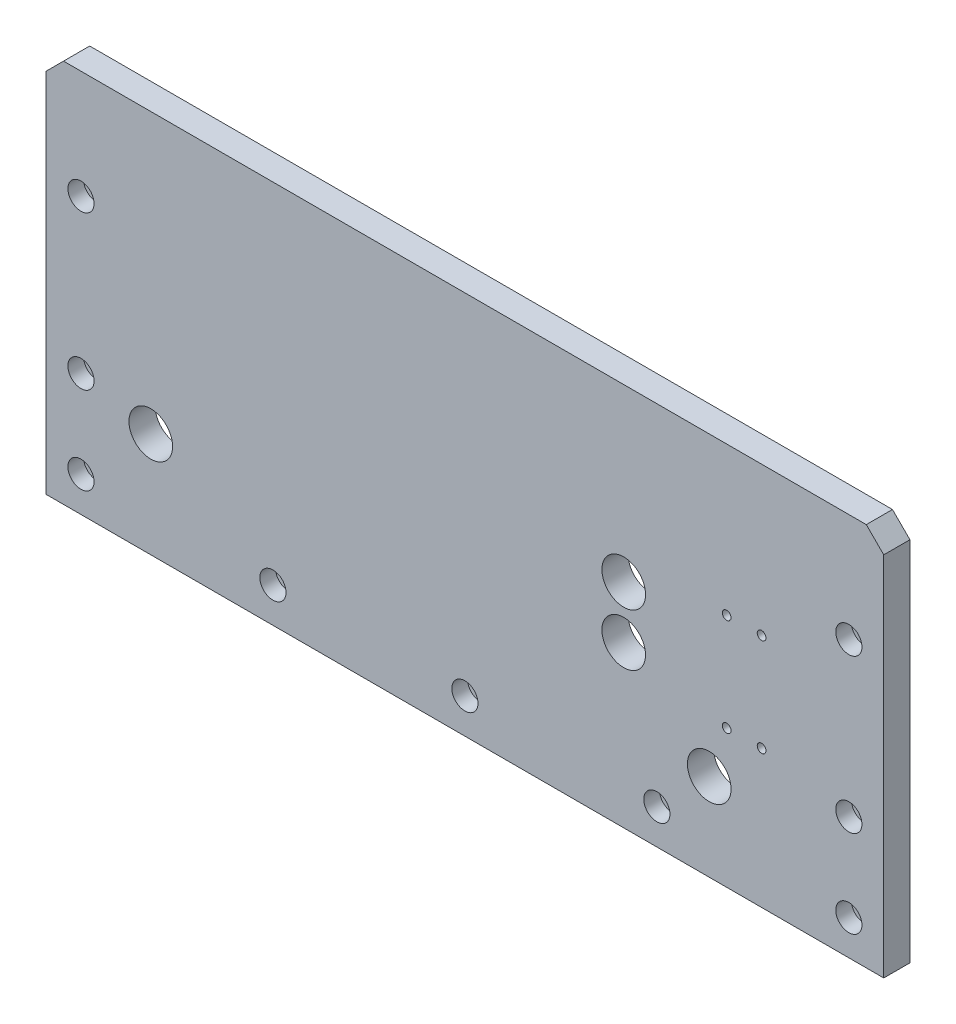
ISO-10303-21;
HEADER;
FILE_DESCRIPTION(('STEP AP214'),'2;1');
FILE_NAME('part.step','',(''),(''),'','','');
FILE_SCHEMA(('AUTOMOTIVE_DESIGN { 1 0 10303 214 1 1 1 1 }'));
ENDSEC;
DATA;
#1=APPLICATION_CONTEXT('core data for automotive mechanical design processes');
#2=APPLICATION_PROTOCOL_DEFINITION('international standard','automotive_design',2000,#1);
#3=PRODUCT_CONTEXT('',#1,'mechanical');
#4=PRODUCT('Part','Part','',(#3));
#5=PRODUCT_RELATED_PRODUCT_CATEGORY('part','',(#4));
#6=PRODUCT_DEFINITION_FORMATION('','',#4);
#7=PRODUCT_DEFINITION_CONTEXT('part definition',#1,'design');
#8=PRODUCT_DEFINITION('design','',#6,#7);
#9=PRODUCT_DEFINITION_SHAPE('','',#8);
#10=(LENGTH_UNIT() NAMED_UNIT(*) SI_UNIT(.MILLI.,.METRE.));
#11=(NAMED_UNIT(*) PLANE_ANGLE_UNIT() SI_UNIT($,.RADIAN.));
#12=(NAMED_UNIT(*) SI_UNIT($,.STERADIAN.) SOLID_ANGLE_UNIT());
#13=UNCERTAINTY_MEASURE_WITH_UNIT(LENGTH_MEASURE(1.E-05),#10,'distance_accuracy_value','');
#14=(GEOMETRIC_REPRESENTATION_CONTEXT(3) GLOBAL_UNCERTAINTY_ASSIGNED_CONTEXT((#13)) GLOBAL_UNIT_ASSIGNED_CONTEXT((#10,
#11,#12)) REPRESENTATION_CONTEXT('',''));
#15=CARTESIAN_POINT('',(0.,0.,0.));
#16=DIRECTION('',(0.,0.,1.));
#17=DIRECTION('',(1.,0.,0.));
#18=AXIS2_PLACEMENT_3D('',#15,#16,#17);
#19=CARTESIAN_POINT('',(240.,-110.,15.));
#20=DIRECTION('',(-1.,0.,0.));
#21=DIRECTION('',(0.,0.,1.));
#22=AXIS2_PLACEMENT_3D('',#19,#20,#21);
#23=PLANE('',#22);
#24=DIRECTION('',(0.,1.,0.));
#25=VECTOR('',#24,1.);
#26=CARTESIAN_POINT('',(240.,-110.,0.));
#27=LINE('',#26,#25);
#28=CARTESIAN_POINT('',(240.,-110.,0.));
#29=VERTEX_POINT('',#28);
#30=CARTESIAN_POINT('',(240.,100.,0.));
#31=VERTEX_POINT('',#30);
#32=EDGE_CURVE('E98',#29,#31,#27,.T.);
#33=ORIENTED_EDGE('',*,*,#32,.T.);
#34=DIRECTION('',(0.,0.,1.));
#35=VECTOR('',#34,1.);
#36=CARTESIAN_POINT('',(240.,100.,15.));
#37=LINE('',#36,#35);
#38=CARTESIAN_POINT('',(240.,100.,15.));
#39=VERTEX_POINT('',#38);
#40=EDGE_CURVE('E11',#31,#39,#37,.T.);
#41=ORIENTED_EDGE('',*,*,#40,.T.);
#42=DIRECTION('',(0.,1.,0.));
#43=VECTOR('',#42,1.);
#44=CARTESIAN_POINT('',(240.,-110.,15.));
#45=LINE('',#44,#43);
#46=CARTESIAN_POINT('',(240.,-110.,15.));
#47=VERTEX_POINT('',#46);
#48=EDGE_CURVE('E105',#47,#39,#45,.T.);
#49=ORIENTED_EDGE('',*,*,#48,.F.);
#50=DIRECTION('',(0.,0.,-1.));
#51=VECTOR('',#50,1.);
#52=CARTESIAN_POINT('',(240.,-110.,15.));
#53=LINE('',#52,#51);
#54=EDGE_CURVE('E90',#47,#29,#53,.T.);
#55=ORIENTED_EDGE('',*,*,#54,.T.);
#56=EDGE_LOOP('',(#33,#41,#49,#55));
#57=FACE_BOUND('',#56,.T.);
#58=ADVANCED_FACE('F16',(#57),#23,.F.);
#59=CARTESIAN_POINT('',(-240.,110.,15.));
#60=DIRECTION('',(0.,-1.,0.));
#61=DIRECTION('',(0.,0.,-1.));
#62=AXIS2_PLACEMENT_3D('',#59,#60,#61);
#63=PLANE('',#62);
#64=DIRECTION('',(-1.,0.,0.));
#65=VECTOR('',#64,1.);
#66=CARTESIAN_POINT('',(-240.,110.,0.));
#67=LINE('',#66,#65);
#68=CARTESIAN_POINT('',(230.,110.,0.));
#69=VERTEX_POINT('',#68);
#70=CARTESIAN_POINT('',(-230.,110.,0.));
#71=VERTEX_POINT('',#70);
#72=EDGE_CURVE('E100',#69,#71,#67,.T.);
#73=ORIENTED_EDGE('',*,*,#72,.T.);
#74=DIRECTION('',(0.,0.,1.));
#75=VECTOR('',#74,1.);
#76=CARTESIAN_POINT('',(-230.,110.,15.));
#77=LINE('',#76,#75);
#78=CARTESIAN_POINT('',(-230.,110.,15.));
#79=VERTEX_POINT('',#78);
#80=EDGE_CURVE('E37',#71,#79,#77,.T.);
#81=ORIENTED_EDGE('',*,*,#80,.T.);
#82=DIRECTION('',(-1.,0.,0.));
#83=VECTOR('',#82,1.);
#84=CARTESIAN_POINT('',(-240.,110.,15.));
#85=LINE('',#84,#83);
#86=CARTESIAN_POINT('',(230.,110.,15.));
#87=VERTEX_POINT('',#86);
#88=EDGE_CURVE('E80',#87,#79,#85,.T.);
#89=ORIENTED_EDGE('',*,*,#88,.F.);
#90=DIRECTION('',(0.,0.,-1.));
#91=VECTOR('',#90,1.);
#92=CARTESIAN_POINT('',(230.,110.,15.));
#93=LINE('',#92,#91);
#94=EDGE_CURVE('E112',#87,#69,#93,.T.);
#95=ORIENTED_EDGE('',*,*,#94,.T.);
#96=EDGE_LOOP('',(#73,#81,#89,#95));
#97=FACE_BOUND('',#96,.T.);
#98=ADVANCED_FACE('F120',(#97),#63,.F.);
#99=CARTESIAN_POINT('',(-240.,-110.,15.));
#100=DIRECTION('',(1.,0.,0.));
#101=DIRECTION('',(0.,0.,-1.));
#102=AXIS2_PLACEMENT_3D('',#99,#100,#101);
#103=PLANE('',#102);
#104=DIRECTION('',(0.,-1.,0.));
#105=VECTOR('',#104,1.);
#106=CARTESIAN_POINT('',(-240.,-110.,15.));
#107=LINE('',#106,#105);
#108=CARTESIAN_POINT('',(-240.,100.,15.));
#109=VERTEX_POINT('',#108);
#110=CARTESIAN_POINT('',(-240.,-110.,15.));
#111=VERTEX_POINT('',#110);
#112=EDGE_CURVE('E70',#109,#111,#107,.T.);
#113=ORIENTED_EDGE('',*,*,#112,.F.);
#114=DIRECTION('',(0.,0.,-1.));
#115=VECTOR('',#114,1.);
#116=CARTESIAN_POINT('',(-240.,100.,15.));
#117=LINE('',#116,#115);
#118=CARTESIAN_POINT('',(-240.,100.,0.));
#119=VERTEX_POINT('',#118);
#120=EDGE_CURVE('E89',#109,#119,#117,.T.);
#121=ORIENTED_EDGE('',*,*,#120,.T.);
#122=DIRECTION('',(0.,-1.,0.));
#123=VECTOR('',#122,1.);
#124=CARTESIAN_POINT('',(-240.,-110.,0.));
#125=LINE('',#124,#123);
#126=CARTESIAN_POINT('',(-240.,-110.,0.));
#127=VERTEX_POINT('',#126);
#128=EDGE_CURVE('E86',#119,#127,#125,.T.);
#129=ORIENTED_EDGE('',*,*,#128,.T.);
#130=DIRECTION('',(0.,0.,-1.));
#131=VECTOR('',#130,1.);
#132=CARTESIAN_POINT('',(-240.,-110.,15.));
#133=LINE('',#132,#131);
#134=EDGE_CURVE('E83',#111,#127,#133,.T.);
#135=ORIENTED_EDGE('',*,*,#134,.F.);
#136=EDGE_LOOP('',(#113,#121,#129,#135));
#137=FACE_BOUND('',#136,.T.);
#138=ADVANCED_FACE('F84',(#137),#103,.F.);
#139=CARTESIAN_POINT('',(-240.,-110.,15.));
#140=DIRECTION('',(0.,1.,0.));
#141=DIRECTION('',(0.,0.,1.));
#142=AXIS2_PLACEMENT_3D('',#139,#140,#141);
#143=PLANE('',#142);
#144=DIRECTION('',(1.,0.,0.));
#145=VECTOR('',#144,1.);
#146=CARTESIAN_POINT('',(-240.,-110.,0.));
#147=LINE('',#146,#145);
#148=EDGE_CURVE('E104',#127,#29,#147,.T.);
#149=ORIENTED_EDGE('',*,*,#148,.T.);
#150=ORIENTED_EDGE('',*,*,#54,.F.);
#151=DIRECTION('',(1.,0.,0.));
#152=VECTOR('',#151,1.);
#153=CARTESIAN_POINT('',(-240.,-110.,15.));
#154=LINE('',#153,#152);
#155=EDGE_CURVE('E74',#111,#47,#154,.T.);
#156=ORIENTED_EDGE('',*,*,#155,.F.);
#157=ORIENTED_EDGE('',*,*,#134,.T.);
#158=EDGE_LOOP('',(#149,#150,#156,#157));
#159=FACE_BOUND('',#158,.T.);
#160=ADVANCED_FACE('F92',(#159),#143,.F.);
#161=CARTESIAN_POINT('',(0.,0.,15.));
#162=DIRECTION('',(0.,0.,-1.));
#163=DIRECTION('',(-1.,0.,0.));
#164=AXIS2_PLACEMENT_3D('',#161,#162,#163);
#165=PLANE('',#164);
#166=CARTESIAN_POINT('',(150.,-31.,15.));
#167=DIRECTION('',(0.,0.,1.));
#168=DIRECTION('',(1.,0.,0.));
#169=AXIS2_PLACEMENT_3D('',#166,#167,#168);
#170=CIRCLE('',#169,2.5);
#171=CARTESIAN_POINT('',(152.5,-31.,15.));
#172=VERTEX_POINT('',#171);
#173=EDGE_CURVE('E279',#172,#172,#170,.T.);
#174=ORIENTED_EDGE('',*,*,#173,.F.);
#175=EDGE_LOOP('',(#174));
#176=FACE_BOUND('',#175,.T.);
#177=CARTESIAN_POINT('',(170.,-31.,15.));
#178=DIRECTION('',(0.,0.,1.));
#179=DIRECTION('',(1.,0.,0.));
#180=AXIS2_PLACEMENT_3D('',#177,#178,#179);
#181=CIRCLE('',#180,2.49999999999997);
#182=CARTESIAN_POINT('',(172.5,-31.,15.));
#183=VERTEX_POINT('',#182);
#184=EDGE_CURVE('E273',#183,#183,#181,.T.);
#185=ORIENTED_EDGE('',*,*,#184,.F.);
#186=EDGE_LOOP('',(#185));
#187=FACE_BOUND('',#186,.T.);
#188=CARTESIAN_POINT('',(150.,25.,15.));
#189=DIRECTION('',(0.,0.,1.));
#190=DIRECTION('',(1.,0.,0.));
#191=AXIS2_PLACEMENT_3D('',#188,#189,#190);
#192=CIRCLE('',#191,2.49999999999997);
#193=CARTESIAN_POINT('',(152.5,25.,15.));
#194=VERTEX_POINT('',#193);
#195=EDGE_CURVE('E267',#194,#194,#192,.T.);
#196=ORIENTED_EDGE('',*,*,#195,.F.);
#197=EDGE_LOOP('',(#196));
#198=FACE_BOUND('',#197,.T.);
#199=CARTESIAN_POINT('',(170.,25.,15.));
#200=DIRECTION('',(0.,0.,1.));
#201=DIRECTION('',(1.,0.,0.));
#202=AXIS2_PLACEMENT_3D('',#199,#200,#201);
#203=CIRCLE('',#202,2.49999999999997);
#204=CARTESIAN_POINT('',(172.5,25.,15.));
#205=VERTEX_POINT('',#204);
#206=EDGE_CURVE('E261',#205,#205,#203,.T.);
#207=ORIENTED_EDGE('',*,*,#206,.F.);
#208=EDGE_LOOP('',(#207));
#209=FACE_BOUND('',#208,.T.);
#210=CARTESIAN_POINT('',(-220.,-90.,15.));
#211=DIRECTION('',(0.,0.,1.));
#212=DIRECTION('',(1.,0.,0.));
#213=AXIS2_PLACEMENT_3D('',#210,#211,#212);
#214=CIRCLE('',#213,7.5);
#215=CARTESIAN_POINT('',(-212.5,-90.,15.));
#216=VERTEX_POINT('',#215);
#217=EDGE_CURVE('E255',#216,#216,#214,.T.);
#218=ORIENTED_EDGE('',*,*,#217,.F.);
#219=EDGE_LOOP('',(#218));
#220=FACE_BOUND('',#219,.T.);
#221=CARTESIAN_POINT('',(-110.,-90.,15.));
#222=DIRECTION('',(0.,0.,1.));
#223=DIRECTION('',(1.,0.,0.));
#224=AXIS2_PLACEMENT_3D('',#221,#222,#223);
#225=CIRCLE('',#224,7.5);
#226=CARTESIAN_POINT('',(-102.5,-90.,15.));
#227=VERTEX_POINT('',#226);
#228=EDGE_CURVE('E243',#227,#227,#225,.T.);
#229=ORIENTED_EDGE('',*,*,#228,.F.);
#230=EDGE_LOOP('',(#229));
#231=FACE_BOUND('',#230,.T.);
#232=CARTESIAN_POINT('',(-2.77555756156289E-13,-90.,15.));
#233=DIRECTION('',(0.,0.,1.));
#234=DIRECTION('',(1.,0.,0.));
#235=AXIS2_PLACEMENT_3D('',#232,#233,#234);
#236=CIRCLE('',#235,7.5);
#237=CARTESIAN_POINT('',(7.49999999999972,-90.,15.));
#238=VERTEX_POINT('',#237);
#239=EDGE_CURVE('E231',#238,#238,#236,.T.);
#240=ORIENTED_EDGE('',*,*,#239,.F.);
#241=EDGE_LOOP('',(#240));
#242=FACE_BOUND('',#241,.T.);
#243=CARTESIAN_POINT('',(110.,-90.,15.));
#244=DIRECTION('',(0.,0.,1.));
#245=DIRECTION('',(1.,0.,0.));
#246=AXIS2_PLACEMENT_3D('',#243,#244,#245);
#247=CIRCLE('',#246,7.5);
#248=CARTESIAN_POINT('',(117.5,-90.,15.));
#249=VERTEX_POINT('',#248);
#250=EDGE_CURVE('E219',#249,#249,#247,.T.);
#251=ORIENTED_EDGE('',*,*,#250,.F.);
#252=EDGE_LOOP('',(#251));
#253=FACE_BOUND('',#252,.T.);
#254=CARTESIAN_POINT('',(220.,-90.,15.));
#255=DIRECTION('',(0.,0.,1.));
#256=DIRECTION('',(1.,0.,0.));
#257=AXIS2_PLACEMENT_3D('',#254,#255,#256);
#258=CIRCLE('',#257,7.5);
#259=CARTESIAN_POINT('',(227.5,-90.,15.));
#260=VERTEX_POINT('',#259);
#261=EDGE_CURVE('E207',#260,#260,#258,.T.);
#262=ORIENTED_EDGE('',*,*,#261,.F.);
#263=EDGE_LOOP('',(#262));
#264=FACE_BOUND('',#263,.T.);
#265=CARTESIAN_POINT('',(-220.,-40.,15.));
#266=DIRECTION('',(0.,0.,1.));
#267=DIRECTION('',(1.,0.,0.));
#268=AXIS2_PLACEMENT_3D('',#265,#266,#267);
#269=CIRCLE('',#268,7.5);
#270=CARTESIAN_POINT('',(-212.5,-40.,15.));
#271=VERTEX_POINT('',#270);
#272=EDGE_CURVE('E195',#271,#271,#269,.T.);
#273=ORIENTED_EDGE('',*,*,#272,.F.);
#274=EDGE_LOOP('',(#273));
#275=FACE_BOUND('',#274,.T.);
#276=CARTESIAN_POINT('',(-220.,48.,15.));
#277=DIRECTION('',(0.,0.,1.));
#278=DIRECTION('',(1.,0.,0.));
#279=AXIS2_PLACEMENT_3D('',#276,#277,#278);
#280=CIRCLE('',#279,7.5);
#281=CARTESIAN_POINT('',(-212.5,48.,15.));
#282=VERTEX_POINT('',#281);
#283=EDGE_CURVE('E183',#282,#282,#280,.T.);
#284=ORIENTED_EDGE('',*,*,#283,.F.);
#285=EDGE_LOOP('',(#284));
#286=FACE_BOUND('',#285,.T.);
#287=CARTESIAN_POINT('',(220.,-40.,15.));
#288=DIRECTION('',(0.,0.,1.));
#289=DIRECTION('',(1.,0.,0.));
#290=AXIS2_PLACEMENT_3D('',#287,#288,#289);
#291=CIRCLE('',#290,7.5);
#292=CARTESIAN_POINT('',(227.5,-40.,15.));
#293=VERTEX_POINT('',#292);
#294=EDGE_CURVE('E171',#293,#293,#291,.T.);
#295=ORIENTED_EDGE('',*,*,#294,.F.);
#296=EDGE_LOOP('',(#295));
#297=FACE_BOUND('',#296,.T.);
#298=CARTESIAN_POINT('',(220.,48.,15.));
#299=DIRECTION('',(0.,0.,1.));
#300=DIRECTION('',(1.,0.,0.));
#301=AXIS2_PLACEMENT_3D('',#298,#299,#300);
#302=CIRCLE('',#301,7.5);
#303=CARTESIAN_POINT('',(227.5,48.,15.));
#304=VERTEX_POINT('',#303);
#305=EDGE_CURVE('E159',#304,#304,#302,.T.);
#306=ORIENTED_EDGE('',*,*,#305,.F.);
#307=EDGE_LOOP('',(#306));
#308=FACE_BOUND('',#307,.T.);
#309=CARTESIAN_POINT('',(-180.,-50.,15.));
#310=DIRECTION('',(0.,0.,1.));
#311=DIRECTION('',(1.,0.,0.));
#312=AXIS2_PLACEMENT_3D('',#309,#310,#311);
#313=CIRCLE('',#312,12.5);
#314=CARTESIAN_POINT('',(-167.5,-50.,15.));
#315=VERTEX_POINT('',#314);
#316=EDGE_CURVE('E145',#315,#315,#313,.T.);
#317=ORIENTED_EDGE('',*,*,#316,.F.);
#318=EDGE_LOOP('',(#317));
#319=FACE_BOUND('',#318,.T.);
#320=CARTESIAN_POINT('',(140.,-60.,15.));
#321=DIRECTION('',(0.,0.,1.));
#322=DIRECTION('',(1.,0.,0.));
#323=AXIS2_PLACEMENT_3D('',#320,#321,#322);
#324=CIRCLE('',#323,12.5);
#325=CARTESIAN_POINT('',(152.5,-60.,15.));
#326=VERTEX_POINT('',#325);
#327=EDGE_CURVE('E139',#326,#326,#324,.T.);
#328=ORIENTED_EDGE('',*,*,#327,.F.);
#329=EDGE_LOOP('',(#328));
#330=FACE_BOUND('',#329,.T.);
#331=CARTESIAN_POINT('',(91.,12.,15.));
#332=DIRECTION('',(0.,0.,1.));
#333=DIRECTION('',(1.,0.,0.));
#334=AXIS2_PLACEMENT_3D('',#331,#332,#333);
#335=CIRCLE('',#334,12.5);
#336=CARTESIAN_POINT('',(103.5,12.,15.));
#337=VERTEX_POINT('',#336);
#338=EDGE_CURVE('E133',#337,#337,#335,.T.);
#339=ORIENTED_EDGE('',*,*,#338,.F.);
#340=EDGE_LOOP('',(#339));
#341=FACE_BOUND('',#340,.T.);
#342=CARTESIAN_POINT('',(91.,-18.,15.));
#343=DIRECTION('',(0.,0.,1.));
#344=DIRECTION('',(1.,0.,0.));
#345=AXIS2_PLACEMENT_3D('',#342,#343,#344);
#346=CIRCLE('',#345,12.5);
#347=CARTESIAN_POINT('',(103.5,-18.,15.));
#348=VERTEX_POINT('',#347);
#349=EDGE_CURVE('E127',#348,#348,#346,.T.);
#350=ORIENTED_EDGE('',*,*,#349,.F.);
#351=EDGE_LOOP('',(#350));
#352=FACE_BOUND('',#351,.T.);
#353=ORIENTED_EDGE('',*,*,#88,.T.);
#354=DIRECTION('',(0.707106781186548,0.707106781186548,0.));
#355=VECTOR('',#354,1.);
#356=CARTESIAN_POINT('',(-240.,100.,15.));
#357=LINE('',#356,#355);
#358=EDGE_CURVE('E24',#79,#109,#357,.F.);
#359=ORIENTED_EDGE('',*,*,#358,.T.);
#360=ORIENTED_EDGE('',*,*,#112,.T.);
#361=ORIENTED_EDGE('',*,*,#155,.T.);
#362=ORIENTED_EDGE('',*,*,#48,.T.);
#363=DIRECTION('',(0.707106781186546,-0.70710678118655,0.));
#364=VECTOR('',#363,1.);
#365=CARTESIAN_POINT('',(230.,110.,15.));
#366=LINE('',#365,#364);
#367=EDGE_CURVE('E116',#39,#87,#366,.F.);
#368=ORIENTED_EDGE('',*,*,#367,.T.);
#369=EDGE_LOOP('',(#353,#359,#360,#361,#362,#368));
#370=FACE_BOUND('',#369,.T.);
#371=ADVANCED_FACE('F72',(#176,#187,#198,#209,#220,#231,#242,#253,#264,#275,#286,#297,#308,#319,
#330,#341,#352,#370),#165,.F.);
#372=CARTESIAN_POINT('',(0.,0.,0.));
#373=DIRECTION('',(0.,0.,-1.));
#374=DIRECTION('',(-1.,0.,0.));
#375=AXIS2_PLACEMENT_3D('',#372,#373,#374);
#376=PLANE('',#375);
#377=CARTESIAN_POINT('',(150.,-31.,0.));
#378=DIRECTION('',(0.,0.,1.));
#379=DIRECTION('',(1.,0.,0.));
#380=AXIS2_PLACEMENT_3D('',#377,#378,#379);
#381=CIRCLE('',#380,2.5);
#382=CARTESIAN_POINT('',(152.5,-31.,0.));
#383=VERTEX_POINT('',#382);
#384=EDGE_CURVE('E276',#383,#383,#381,.T.);
#385=ORIENTED_EDGE('',*,*,#384,.T.);
#386=EDGE_LOOP('',(#385));
#387=FACE_BOUND('',#386,.T.);
#388=CARTESIAN_POINT('',(170.,-31.,0.));
#389=DIRECTION('',(0.,0.,1.));
#390=DIRECTION('',(1.,0.,0.));
#391=AXIS2_PLACEMENT_3D('',#388,#389,#390);
#392=CIRCLE('',#391,2.5);
#393=CARTESIAN_POINT('',(172.5,-31.,0.));
#394=VERTEX_POINT('',#393);
#395=EDGE_CURVE('E270',#394,#394,#392,.T.);
#396=ORIENTED_EDGE('',*,*,#395,.T.);
#397=EDGE_LOOP('',(#396));
#398=FACE_BOUND('',#397,.T.);
#399=CARTESIAN_POINT('',(150.,25.,0.));
#400=DIRECTION('',(0.,0.,1.));
#401=DIRECTION('',(1.,0.,0.));
#402=AXIS2_PLACEMENT_3D('',#399,#400,#401);
#403=CIRCLE('',#402,2.5);
#404=CARTESIAN_POINT('',(152.5,25.,0.));
#405=VERTEX_POINT('',#404);
#406=EDGE_CURVE('E264',#405,#405,#403,.T.);
#407=ORIENTED_EDGE('',*,*,#406,.T.);
#408=EDGE_LOOP('',(#407));
#409=FACE_BOUND('',#408,.T.);
#410=CARTESIAN_POINT('',(170.,25.,0.));
#411=DIRECTION('',(0.,0.,1.));
#412=DIRECTION('',(1.,0.,0.));
#413=AXIS2_PLACEMENT_3D('',#410,#411,#412);
#414=CIRCLE('',#413,2.5);
#415=CARTESIAN_POINT('',(172.5,25.,0.));
#416=VERTEX_POINT('',#415);
#417=EDGE_CURVE('E258',#416,#416,#414,.T.);
#418=ORIENTED_EDGE('',*,*,#417,.T.);
#419=EDGE_LOOP('',(#418));
#420=FACE_BOUND('',#419,.T.);
#421=CARTESIAN_POINT('',(-220.,-90.,0.));
#422=DIRECTION('',(0.,0.,1.));
#423=DIRECTION('',(1.,0.,0.));
#424=AXIS2_PLACEMENT_3D('',#421,#422,#423);
#425=CIRCLE('',#424,4.5);
#426=CARTESIAN_POINT('',(-215.5,-90.,0.));
#427=VERTEX_POINT('',#426);
#428=EDGE_CURVE('E246',#427,#427,#425,.T.);
#429=ORIENTED_EDGE('',*,*,#428,.T.);
#430=EDGE_LOOP('',(#429));
#431=FACE_BOUND('',#430,.T.);
#432=CARTESIAN_POINT('',(-110.,-90.,0.));
#433=DIRECTION('',(0.,0.,1.));
#434=DIRECTION('',(1.,0.,0.));
#435=AXIS2_PLACEMENT_3D('',#432,#433,#434);
#436=CIRCLE('',#435,4.5);
#437=CARTESIAN_POINT('',(-105.5,-90.,0.));
#438=VERTEX_POINT('',#437);
#439=EDGE_CURVE('E234',#438,#438,#436,.T.);
#440=ORIENTED_EDGE('',*,*,#439,.T.);
#441=EDGE_LOOP('',(#440));
#442=FACE_BOUND('',#441,.T.);
#443=CARTESIAN_POINT('',(-2.77555756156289E-13,-90.,0.));
#444=DIRECTION('',(0.,0.,1.));
#445=DIRECTION('',(1.,0.,0.));
#446=AXIS2_PLACEMENT_3D('',#443,#444,#445);
#447=CIRCLE('',#446,4.5);
#448=CARTESIAN_POINT('',(4.49999999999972,-90.,0.));
#449=VERTEX_POINT('',#448);
#450=EDGE_CURVE('E222',#449,#449,#447,.T.);
#451=ORIENTED_EDGE('',*,*,#450,.T.);
#452=EDGE_LOOP('',(#451));
#453=FACE_BOUND('',#452,.T.);
#454=CARTESIAN_POINT('',(110.,-90.,0.));
#455=DIRECTION('',(0.,0.,1.));
#456=DIRECTION('',(1.,0.,0.));
#457=AXIS2_PLACEMENT_3D('',#454,#455,#456);
#458=CIRCLE('',#457,4.5);
#459=CARTESIAN_POINT('',(114.5,-90.,0.));
#460=VERTEX_POINT('',#459);
#461=EDGE_CURVE('E210',#460,#460,#458,.T.);
#462=ORIENTED_EDGE('',*,*,#461,.T.);
#463=EDGE_LOOP('',(#462));
#464=FACE_BOUND('',#463,.T.);
#465=CARTESIAN_POINT('',(220.,-90.,0.));
#466=DIRECTION('',(0.,0.,1.));
#467=DIRECTION('',(1.,0.,0.));
#468=AXIS2_PLACEMENT_3D('',#465,#466,#467);
#469=CIRCLE('',#468,4.5);
#470=CARTESIAN_POINT('',(224.5,-90.,0.));
#471=VERTEX_POINT('',#470);
#472=EDGE_CURVE('E198',#471,#471,#469,.T.);
#473=ORIENTED_EDGE('',*,*,#472,.T.);
#474=EDGE_LOOP('',(#473));
#475=FACE_BOUND('',#474,.T.);
#476=CARTESIAN_POINT('',(-220.,-40.,0.));
#477=DIRECTION('',(0.,0.,1.));
#478=DIRECTION('',(1.,0.,0.));
#479=AXIS2_PLACEMENT_3D('',#476,#477,#478);
#480=CIRCLE('',#479,4.5);
#481=CARTESIAN_POINT('',(-215.5,-40.,0.));
#482=VERTEX_POINT('',#481);
#483=EDGE_CURVE('E186',#482,#482,#480,.T.);
#484=ORIENTED_EDGE('',*,*,#483,.T.);
#485=EDGE_LOOP('',(#484));
#486=FACE_BOUND('',#485,.T.);
#487=CARTESIAN_POINT('',(-220.,48.,0.));
#488=DIRECTION('',(0.,0.,1.));
#489=DIRECTION('',(1.,0.,0.));
#490=AXIS2_PLACEMENT_3D('',#487,#488,#489);
#491=CIRCLE('',#490,4.5);
#492=CARTESIAN_POINT('',(-215.5,48.,0.));
#493=VERTEX_POINT('',#492);
#494=EDGE_CURVE('E174',#493,#493,#491,.T.);
#495=ORIENTED_EDGE('',*,*,#494,.T.);
#496=EDGE_LOOP('',(#495));
#497=FACE_BOUND('',#496,.T.);
#498=CARTESIAN_POINT('',(220.,-40.,0.));
#499=DIRECTION('',(0.,0.,1.));
#500=DIRECTION('',(1.,0.,0.));
#501=AXIS2_PLACEMENT_3D('',#498,#499,#500);
#502=CIRCLE('',#501,4.5);
#503=CARTESIAN_POINT('',(224.5,-40.,0.));
#504=VERTEX_POINT('',#503);
#505=EDGE_CURVE('E162',#504,#504,#502,.T.);
#506=ORIENTED_EDGE('',*,*,#505,.T.);
#507=EDGE_LOOP('',(#506));
#508=FACE_BOUND('',#507,.T.);
#509=CARTESIAN_POINT('',(220.,48.,0.));
#510=DIRECTION('',(0.,0.,1.));
#511=DIRECTION('',(1.,0.,0.));
#512=AXIS2_PLACEMENT_3D('',#509,#510,#511);
#513=CIRCLE('',#512,4.5);
#514=CARTESIAN_POINT('',(224.5,48.,0.));
#515=VERTEX_POINT('',#514);
#516=EDGE_CURVE('E148',#515,#515,#513,.T.);
#517=ORIENTED_EDGE('',*,*,#516,.T.);
#518=EDGE_LOOP('',(#517));
#519=FACE_BOUND('',#518,.T.);
#520=CARTESIAN_POINT('',(-180.,-50.,0.));
#521=DIRECTION('',(0.,0.,1.));
#522=DIRECTION('',(1.,0.,0.));
#523=AXIS2_PLACEMENT_3D('',#520,#521,#522);
#524=CIRCLE('',#523,12.5);
#525=CARTESIAN_POINT('',(-167.5,-50.,0.));
#526=VERTEX_POINT('',#525);
#527=EDGE_CURVE('E142',#526,#526,#524,.T.);
#528=ORIENTED_EDGE('',*,*,#527,.T.);
#529=EDGE_LOOP('',(#528));
#530=FACE_BOUND('',#529,.T.);
#531=CARTESIAN_POINT('',(140.,-60.,0.));
#532=DIRECTION('',(0.,0.,1.));
#533=DIRECTION('',(1.,0.,0.));
#534=AXIS2_PLACEMENT_3D('',#531,#532,#533);
#535=CIRCLE('',#534,12.5);
#536=CARTESIAN_POINT('',(152.5,-60.,0.));
#537=VERTEX_POINT('',#536);
#538=EDGE_CURVE('E136',#537,#537,#535,.T.);
#539=ORIENTED_EDGE('',*,*,#538,.T.);
#540=EDGE_LOOP('',(#539));
#541=FACE_BOUND('',#540,.T.);
#542=CARTESIAN_POINT('',(91.,12.,0.));
#543=DIRECTION('',(0.,0.,1.));
#544=DIRECTION('',(1.,0.,0.));
#545=AXIS2_PLACEMENT_3D('',#542,#543,#544);
#546=CIRCLE('',#545,12.5);
#547=CARTESIAN_POINT('',(103.5,12.,0.));
#548=VERTEX_POINT('',#547);
#549=EDGE_CURVE('E130',#548,#548,#546,.T.);
#550=ORIENTED_EDGE('',*,*,#549,.T.);
#551=EDGE_LOOP('',(#550));
#552=FACE_BOUND('',#551,.T.);
#553=CARTESIAN_POINT('',(91.,-18.,0.));
#554=DIRECTION('',(0.,0.,1.));
#555=DIRECTION('',(1.,0.,0.));
#556=AXIS2_PLACEMENT_3D('',#553,#554,#555);
#557=CIRCLE('',#556,12.5);
#558=CARTESIAN_POINT('',(103.5,-18.,0.));
#559=VERTEX_POINT('',#558);
#560=EDGE_CURVE('E101',#559,#559,#557,.T.);
#561=ORIENTED_EDGE('',*,*,#560,.T.);
#562=EDGE_LOOP('',(#561));
#563=FACE_BOUND('',#562,.T.);
#564=ORIENTED_EDGE('',*,*,#128,.F.);
#565=DIRECTION('',(-0.707106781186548,-0.707106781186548,0.));
#566=VECTOR('',#565,1.);
#567=CARTESIAN_POINT('',(-170.,170.,0.));
#568=LINE('',#567,#566);
#569=EDGE_CURVE('E110',#119,#71,#568,.F.);
#570=ORIENTED_EDGE('',*,*,#569,.T.);
#571=ORIENTED_EDGE('',*,*,#72,.F.);
#572=DIRECTION('',(-0.707106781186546,0.70710678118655,0.));
#573=VECTOR('',#572,1.);
#574=CARTESIAN_POINT('',(170.,170.,0.));
#575=LINE('',#574,#573);
#576=EDGE_CURVE('E108',#69,#31,#575,.F.);
#577=ORIENTED_EDGE('',*,*,#576,.T.);
#578=ORIENTED_EDGE('',*,*,#32,.F.);
#579=ORIENTED_EDGE('',*,*,#148,.F.);
#580=EDGE_LOOP('',(#564,#570,#571,#577,#578,#579));
#581=FACE_BOUND('',#580,.T.);
#582=ADVANCED_FACE('F124',(#387,#398,#409,#420,#431,#442,#453,#464,#475,#486,#497,#508,#519,
#530,#541,#552,#563,#581),#376,.T.);
#583=CARTESIAN_POINT('',(91.,-18.,0.));
#584=DIRECTION('',(0.,0.,1.));
#585=DIRECTION('',(1.,0.,0.));
#586=AXIS2_PLACEMENT_3D('',#583,#584,#585);
#587=CYLINDRICAL_SURFACE('',#586,12.5);
#588=ORIENTED_EDGE('',*,*,#560,.F.);
#589=EDGE_LOOP('',(#588));
#590=FACE_BOUND('',#589,.T.);
#591=ORIENTED_EDGE('',*,*,#349,.T.);
#592=EDGE_LOOP('',(#591));
#593=FACE_BOUND('',#592,.T.);
#594=ADVANCED_FACE('F320',(#590,#593),#587,.F.);
#595=CARTESIAN_POINT('',(91.,12.,0.));
#596=DIRECTION('',(0.,0.,1.));
#597=DIRECTION('',(1.,0.,0.));
#598=AXIS2_PLACEMENT_3D('',#595,#596,#597);
#599=CYLINDRICAL_SURFACE('',#598,12.5);
#600=ORIENTED_EDGE('',*,*,#549,.F.);
#601=EDGE_LOOP('',(#600));
#602=FACE_BOUND('',#601,.T.);
#603=ORIENTED_EDGE('',*,*,#338,.T.);
#604=EDGE_LOOP('',(#603));
#605=FACE_BOUND('',#604,.T.);
#606=ADVANCED_FACE('F322',(#602,#605),#599,.F.);
#607=CARTESIAN_POINT('',(140.,-60.,0.));
#608=DIRECTION('',(0.,0.,1.));
#609=DIRECTION('',(1.,0.,0.));
#610=AXIS2_PLACEMENT_3D('',#607,#608,#609);
#611=CYLINDRICAL_SURFACE('',#610,12.5);
#612=ORIENTED_EDGE('',*,*,#538,.F.);
#613=EDGE_LOOP('',(#612));
#614=FACE_BOUND('',#613,.T.);
#615=ORIENTED_EDGE('',*,*,#327,.T.);
#616=EDGE_LOOP('',(#615));
#617=FACE_BOUND('',#616,.T.);
#618=ADVANCED_FACE('F331',(#614,#617),#611,.F.);
#619=CARTESIAN_POINT('',(-180.,-50.,0.));
#620=DIRECTION('',(0.,0.,1.));
#621=DIRECTION('',(1.,0.,0.));
#622=AXIS2_PLACEMENT_3D('',#619,#620,#621);
#623=CYLINDRICAL_SURFACE('',#622,12.5);
#624=ORIENTED_EDGE('',*,*,#527,.F.);
#625=EDGE_LOOP('',(#624));
#626=FACE_BOUND('',#625,.T.);
#627=ORIENTED_EDGE('',*,*,#316,.T.);
#628=EDGE_LOOP('',(#627));
#629=FACE_BOUND('',#628,.T.);
#630=ADVANCED_FACE('F347',(#626,#629),#623,.F.);
#631=CARTESIAN_POINT('',(-240.,100.,15.));
#632=DIRECTION('',(0.707106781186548,-0.707106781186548,0.));
#633=DIRECTION('',(0.,0.,-1.));
#634=AXIS2_PLACEMENT_3D('',#631,#632,#633);
#635=PLANE('',#634);
#636=ORIENTED_EDGE('',*,*,#358,.F.);
#637=ORIENTED_EDGE('',*,*,#80,.F.);
#638=ORIENTED_EDGE('',*,*,#569,.F.);
#639=ORIENTED_EDGE('',*,*,#120,.F.);
#640=EDGE_LOOP('',(#636,#637,#638,#639));
#641=FACE_BOUND('',#640,.T.);
#642=ADVANCED_FACE('F345',(#641),#635,.F.);
#643=CARTESIAN_POINT('',(230.,110.,15.));
#644=DIRECTION('',(-0.707106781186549,-0.707106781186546,0.));
#645=DIRECTION('',(0.,0.,-1.));
#646=AXIS2_PLACEMENT_3D('',#643,#644,#645);
#647=PLANE('',#646);
#648=ORIENTED_EDGE('',*,*,#367,.F.);
#649=ORIENTED_EDGE('',*,*,#40,.F.);
#650=ORIENTED_EDGE('',*,*,#576,.F.);
#651=ORIENTED_EDGE('',*,*,#94,.F.);
#652=EDGE_LOOP('',(#648,#649,#650,#651));
#653=FACE_BOUND('',#652,.T.);
#654=ADVANCED_FACE('F18',(#653),#647,.F.);
#655=CARTESIAN_POINT('',(220.,48.,15.));
#656=DIRECTION('',(0.,0.,1.));
#657=DIRECTION('',(1.,0.,0.));
#658=AXIS2_PLACEMENT_3D('',#655,#656,#657);
#659=CYLINDRICAL_SURFACE('',#658,4.5);
#660=ORIENTED_EDGE('',*,*,#516,.F.);
#661=EDGE_LOOP('',(#660));
#662=FACE_BOUND('',#661,.T.);
#663=CARTESIAN_POINT('',(220.,48.,6.));
#664=DIRECTION('',(0.,0.,1.));
#665=DIRECTION('',(1.,0.,0.));
#666=AXIS2_PLACEMENT_3D('',#663,#664,#665);
#667=CIRCLE('',#666,4.5);
#668=CARTESIAN_POINT('',(224.5,48.,6.));
#669=VERTEX_POINT('',#668);
#670=EDGE_CURVE('E153',#669,#669,#667,.T.);
#671=ORIENTED_EDGE('',*,*,#670,.T.);
#672=EDGE_LOOP('',(#671));
#673=FACE_BOUND('',#672,.T.);
#674=ADVANCED_FACE('F354',(#662,#673),#659,.F.);
#675=CARTESIAN_POINT('',(224.5,48.,6.));
#676=DIRECTION('',(0.,0.,-1.));
#677=DIRECTION('',(-1.,0.,0.));
#678=AXIS2_PLACEMENT_3D('',#675,#676,#677);
#679=PLANE('',#678);
#680=ORIENTED_EDGE('',*,*,#670,.F.);
#681=EDGE_LOOP('',(#680));
#682=FACE_BOUND('',#681,.T.);
#683=CARTESIAN_POINT('',(220.,48.,6.));
#684=DIRECTION('',(0.,0.,1.));
#685=DIRECTION('',(1.,0.,0.));
#686=AXIS2_PLACEMENT_3D('',#683,#684,#685);
#687=CIRCLE('',#686,7.5);
#688=CARTESIAN_POINT('',(227.5,48.,6.));
#689=VERTEX_POINT('',#688);
#690=EDGE_CURVE('E156',#689,#689,#687,.T.);
#691=ORIENTED_EDGE('',*,*,#690,.T.);
#692=EDGE_LOOP('',(#691));
#693=FACE_BOUND('',#692,.T.);
#694=ADVANCED_FACE('F368',(#682,#693),#679,.F.);
#695=CARTESIAN_POINT('',(220.,48.,15.));
#696=DIRECTION('',(0.,0.,1.));
#697=DIRECTION('',(1.,0.,0.));
#698=AXIS2_PLACEMENT_3D('',#695,#696,#697);
#699=CYLINDRICAL_SURFACE('',#698,7.5);
#700=ORIENTED_EDGE('',*,*,#690,.F.);
#701=EDGE_LOOP('',(#700));
#702=FACE_BOUND('',#701,.T.);
#703=ORIENTED_EDGE('',*,*,#305,.T.);
#704=EDGE_LOOP('',(#703));
#705=FACE_BOUND('',#704,.T.);
#706=ADVANCED_FACE('F372',(#702,#705),#699,.F.);
#707=CARTESIAN_POINT('',(220.,-40.,15.));
#708=DIRECTION('',(0.,0.,1.));
#709=DIRECTION('',(1.,0.,0.));
#710=AXIS2_PLACEMENT_3D('',#707,#708,#709);
#711=CYLINDRICAL_SURFACE('',#710,4.5);
#712=ORIENTED_EDGE('',*,*,#505,.F.);
#713=EDGE_LOOP('',(#712));
#714=FACE_BOUND('',#713,.T.);
#715=CARTESIAN_POINT('',(220.,-40.,6.));
#716=DIRECTION('',(0.,0.,1.));
#717=DIRECTION('',(1.,0.,0.));
#718=AXIS2_PLACEMENT_3D('',#715,#716,#717);
#719=CIRCLE('',#718,4.5);
#720=CARTESIAN_POINT('',(224.5,-40.,6.));
#721=VERTEX_POINT('',#720);
#722=EDGE_CURVE('E165',#721,#721,#719,.T.);
#723=ORIENTED_EDGE('',*,*,#722,.T.);
#724=EDGE_LOOP('',(#723));
#725=FACE_BOUND('',#724,.T.);
#726=ADVANCED_FACE('F376',(#714,#725),#711,.F.);
#727=CARTESIAN_POINT('',(224.5,-40.,6.));
#728=DIRECTION('',(0.,0.,-1.));
#729=DIRECTION('',(-1.,0.,0.));
#730=AXIS2_PLACEMENT_3D('',#727,#728,#729);
#731=PLANE('',#730);
#732=ORIENTED_EDGE('',*,*,#722,.F.);
#733=EDGE_LOOP('',(#732));
#734=FACE_BOUND('',#733,.T.);
#735=CARTESIAN_POINT('',(220.,-40.,6.));
#736=DIRECTION('',(0.,0.,1.));
#737=DIRECTION('',(1.,0.,0.));
#738=AXIS2_PLACEMENT_3D('',#735,#736,#737);
#739=CIRCLE('',#738,7.5);
#740=CARTESIAN_POINT('',(227.5,-40.,6.));
#741=VERTEX_POINT('',#740);
#742=EDGE_CURVE('E168',#741,#741,#739,.T.);
#743=ORIENTED_EDGE('',*,*,#742,.T.);
#744=EDGE_LOOP('',(#743));
#745=FACE_BOUND('',#744,.T.);
#746=ADVANCED_FACE('F380',(#734,#745),#731,.F.);
#747=CARTESIAN_POINT('',(220.,-40.,15.));
#748=DIRECTION('',(0.,0.,1.));
#749=DIRECTION('',(1.,0.,0.));
#750=AXIS2_PLACEMENT_3D('',#747,#748,#749);
#751=CYLINDRICAL_SURFACE('',#750,7.5);
#752=ORIENTED_EDGE('',*,*,#742,.F.);
#753=EDGE_LOOP('',(#752));
#754=FACE_BOUND('',#753,.T.);
#755=ORIENTED_EDGE('',*,*,#294,.T.);
#756=EDGE_LOOP('',(#755));
#757=FACE_BOUND('',#756,.T.);
#758=ADVANCED_FACE('F384',(#754,#757),#751,.F.);
#759=CARTESIAN_POINT('',(-220.,48.,15.));
#760=DIRECTION('',(0.,0.,1.));
#761=DIRECTION('',(1.,0.,0.));
#762=AXIS2_PLACEMENT_3D('',#759,#760,#761);
#763=CYLINDRICAL_SURFACE('',#762,4.5);
#764=ORIENTED_EDGE('',*,*,#494,.F.);
#765=EDGE_LOOP('',(#764));
#766=FACE_BOUND('',#765,.T.);
#767=CARTESIAN_POINT('',(-220.,48.,6.));
#768=DIRECTION('',(0.,0.,1.));
#769=DIRECTION('',(1.,0.,0.));
#770=AXIS2_PLACEMENT_3D('',#767,#768,#769);
#771=CIRCLE('',#770,4.5);
#772=CARTESIAN_POINT('',(-215.5,48.,6.));
#773=VERTEX_POINT('',#772);
#774=EDGE_CURVE('E177',#773,#773,#771,.T.);
#775=ORIENTED_EDGE('',*,*,#774,.T.);
#776=EDGE_LOOP('',(#775));
#777=FACE_BOUND('',#776,.T.);
#778=ADVANCED_FACE('F388',(#766,#777),#763,.F.);
#779=CARTESIAN_POINT('',(-215.5,48.,6.));
#780=DIRECTION('',(0.,0.,-1.));
#781=DIRECTION('',(-1.,0.,0.));
#782=AXIS2_PLACEMENT_3D('',#779,#780,#781);
#783=PLANE('',#782);
#784=ORIENTED_EDGE('',*,*,#774,.F.);
#785=EDGE_LOOP('',(#784));
#786=FACE_BOUND('',#785,.T.);
#787=CARTESIAN_POINT('',(-220.,48.,6.));
#788=DIRECTION('',(0.,0.,1.));
#789=DIRECTION('',(1.,0.,0.));
#790=AXIS2_PLACEMENT_3D('',#787,#788,#789);
#791=CIRCLE('',#790,7.5);
#792=CARTESIAN_POINT('',(-212.5,48.,6.));
#793=VERTEX_POINT('',#792);
#794=EDGE_CURVE('E180',#793,#793,#791,.T.);
#795=ORIENTED_EDGE('',*,*,#794,.T.);
#796=EDGE_LOOP('',(#795));
#797=FACE_BOUND('',#796,.T.);
#798=ADVANCED_FACE('F392',(#786,#797),#783,.F.);
#799=CARTESIAN_POINT('',(-220.,48.,15.));
#800=DIRECTION('',(0.,0.,1.));
#801=DIRECTION('',(1.,0.,0.));
#802=AXIS2_PLACEMENT_3D('',#799,#800,#801);
#803=CYLINDRICAL_SURFACE('',#802,7.5);
#804=ORIENTED_EDGE('',*,*,#794,.F.);
#805=EDGE_LOOP('',(#804));
#806=FACE_BOUND('',#805,.T.);
#807=ORIENTED_EDGE('',*,*,#283,.T.);
#808=EDGE_LOOP('',(#807));
#809=FACE_BOUND('',#808,.T.);
#810=ADVANCED_FACE('F396',(#806,#809),#803,.F.);
#811=CARTESIAN_POINT('',(-220.,-40.,15.));
#812=DIRECTION('',(0.,0.,1.));
#813=DIRECTION('',(1.,0.,0.));
#814=AXIS2_PLACEMENT_3D('',#811,#812,#813);
#815=CYLINDRICAL_SURFACE('',#814,4.5);
#816=ORIENTED_EDGE('',*,*,#483,.F.);
#817=EDGE_LOOP('',(#816));
#818=FACE_BOUND('',#817,.T.);
#819=CARTESIAN_POINT('',(-220.,-40.,6.));
#820=DIRECTION('',(0.,0.,1.));
#821=DIRECTION('',(1.,0.,0.));
#822=AXIS2_PLACEMENT_3D('',#819,#820,#821);
#823=CIRCLE('',#822,4.5);
#824=CARTESIAN_POINT('',(-215.5,-40.,6.));
#825=VERTEX_POINT('',#824);
#826=EDGE_CURVE('E189',#825,#825,#823,.T.);
#827=ORIENTED_EDGE('',*,*,#826,.T.);
#828=EDGE_LOOP('',(#827));
#829=FACE_BOUND('',#828,.T.);
#830=ADVANCED_FACE('F400',(#818,#829),#815,.F.);
#831=CARTESIAN_POINT('',(-215.5,-40.,6.));
#832=DIRECTION('',(0.,0.,-1.));
#833=DIRECTION('',(-1.,0.,0.));
#834=AXIS2_PLACEMENT_3D('',#831,#832,#833);
#835=PLANE('',#834);
#836=ORIENTED_EDGE('',*,*,#826,.F.);
#837=EDGE_LOOP('',(#836));
#838=FACE_BOUND('',#837,.T.);
#839=CARTESIAN_POINT('',(-220.,-40.,6.));
#840=DIRECTION('',(0.,0.,1.));
#841=DIRECTION('',(1.,0.,0.));
#842=AXIS2_PLACEMENT_3D('',#839,#840,#841);
#843=CIRCLE('',#842,7.5);
#844=CARTESIAN_POINT('',(-212.5,-40.,6.));
#845=VERTEX_POINT('',#844);
#846=EDGE_CURVE('E192',#845,#845,#843,.T.);
#847=ORIENTED_EDGE('',*,*,#846,.T.);
#848=EDGE_LOOP('',(#847));
#849=FACE_BOUND('',#848,.T.);
#850=ADVANCED_FACE('F404',(#838,#849),#835,.F.);
#851=CARTESIAN_POINT('',(-220.,-40.,15.));
#852=DIRECTION('',(0.,0.,1.));
#853=DIRECTION('',(1.,0.,0.));
#854=AXIS2_PLACEMENT_3D('',#851,#852,#853);
#855=CYLINDRICAL_SURFACE('',#854,7.5);
#856=ORIENTED_EDGE('',*,*,#846,.F.);
#857=EDGE_LOOP('',(#856));
#858=FACE_BOUND('',#857,.T.);
#859=ORIENTED_EDGE('',*,*,#272,.T.);
#860=EDGE_LOOP('',(#859));
#861=FACE_BOUND('',#860,.T.);
#862=ADVANCED_FACE('F408',(#858,#861),#855,.F.);
#863=CARTESIAN_POINT('',(220.,-90.,15.));
#864=DIRECTION('',(0.,0.,1.));
#865=DIRECTION('',(1.,0.,0.));
#866=AXIS2_PLACEMENT_3D('',#863,#864,#865);
#867=CYLINDRICAL_SURFACE('',#866,4.5);
#868=ORIENTED_EDGE('',*,*,#472,.F.);
#869=EDGE_LOOP('',(#868));
#870=FACE_BOUND('',#869,.T.);
#871=CARTESIAN_POINT('',(220.,-90.,6.));
#872=DIRECTION('',(0.,0.,1.));
#873=DIRECTION('',(1.,0.,0.));
#874=AXIS2_PLACEMENT_3D('',#871,#872,#873);
#875=CIRCLE('',#874,4.5);
#876=CARTESIAN_POINT('',(224.5,-90.,6.));
#877=VERTEX_POINT('',#876);
#878=EDGE_CURVE('E201',#877,#877,#875,.T.);
#879=ORIENTED_EDGE('',*,*,#878,.T.);
#880=EDGE_LOOP('',(#879));
#881=FACE_BOUND('',#880,.T.);
#882=ADVANCED_FACE('F412',(#870,#881),#867,.F.);
#883=CARTESIAN_POINT('',(224.5,-90.,6.));
#884=DIRECTION('',(0.,0.,-1.));
#885=DIRECTION('',(-1.,0.,0.));
#886=AXIS2_PLACEMENT_3D('',#883,#884,#885);
#887=PLANE('',#886);
#888=ORIENTED_EDGE('',*,*,#878,.F.);
#889=EDGE_LOOP('',(#888));
#890=FACE_BOUND('',#889,.T.);
#891=CARTESIAN_POINT('',(220.,-90.,6.));
#892=DIRECTION('',(0.,0.,1.));
#893=DIRECTION('',(1.,0.,0.));
#894=AXIS2_PLACEMENT_3D('',#891,#892,#893);
#895=CIRCLE('',#894,7.5);
#896=CARTESIAN_POINT('',(227.5,-90.,6.));
#897=VERTEX_POINT('',#896);
#898=EDGE_CURVE('E204',#897,#897,#895,.T.);
#899=ORIENTED_EDGE('',*,*,#898,.T.);
#900=EDGE_LOOP('',(#899));
#901=FACE_BOUND('',#900,.T.);
#902=ADVANCED_FACE('F416',(#890,#901),#887,.F.);
#903=CARTESIAN_POINT('',(220.,-90.,15.));
#904=DIRECTION('',(0.,0.,1.));
#905=DIRECTION('',(1.,0.,0.));
#906=AXIS2_PLACEMENT_3D('',#903,#904,#905);
#907=CYLINDRICAL_SURFACE('',#906,7.5);
#908=ORIENTED_EDGE('',*,*,#898,.F.);
#909=EDGE_LOOP('',(#908));
#910=FACE_BOUND('',#909,.T.);
#911=ORIENTED_EDGE('',*,*,#261,.T.);
#912=EDGE_LOOP('',(#911));
#913=FACE_BOUND('',#912,.T.);
#914=ADVANCED_FACE('F420',(#910,#913),#907,.F.);
#915=CARTESIAN_POINT('',(110.,-90.,15.));
#916=DIRECTION('',(0.,0.,1.));
#917=DIRECTION('',(1.,0.,0.));
#918=AXIS2_PLACEMENT_3D('',#915,#916,#917);
#919=CYLINDRICAL_SURFACE('',#918,4.5);
#920=ORIENTED_EDGE('',*,*,#461,.F.);
#921=EDGE_LOOP('',(#920));
#922=FACE_BOUND('',#921,.T.);
#923=CARTESIAN_POINT('',(110.,-90.,6.));
#924=DIRECTION('',(0.,0.,1.));
#925=DIRECTION('',(1.,0.,0.));
#926=AXIS2_PLACEMENT_3D('',#923,#924,#925);
#927=CIRCLE('',#926,4.5);
#928=CARTESIAN_POINT('',(114.5,-90.,6.));
#929=VERTEX_POINT('',#928);
#930=EDGE_CURVE('E213',#929,#929,#927,.T.);
#931=ORIENTED_EDGE('',*,*,#930,.T.);
#932=EDGE_LOOP('',(#931));
#933=FACE_BOUND('',#932,.T.);
#934=ADVANCED_FACE('F424',(#922,#933),#919,.F.);
#935=CARTESIAN_POINT('',(114.5,-90.,6.));
#936=DIRECTION('',(0.,0.,-1.));
#937=DIRECTION('',(-1.,0.,0.));
#938=AXIS2_PLACEMENT_3D('',#935,#936,#937);
#939=PLANE('',#938);
#940=ORIENTED_EDGE('',*,*,#930,.F.);
#941=EDGE_LOOP('',(#940));
#942=FACE_BOUND('',#941,.T.);
#943=CARTESIAN_POINT('',(110.,-90.,6.));
#944=DIRECTION('',(0.,0.,1.));
#945=DIRECTION('',(1.,0.,0.));
#946=AXIS2_PLACEMENT_3D('',#943,#944,#945);
#947=CIRCLE('',#946,7.5);
#948=CARTESIAN_POINT('',(117.5,-90.,6.));
#949=VERTEX_POINT('',#948);
#950=EDGE_CURVE('E216',#949,#949,#947,.T.);
#951=ORIENTED_EDGE('',*,*,#950,.T.);
#952=EDGE_LOOP('',(#951));
#953=FACE_BOUND('',#952,.T.);
#954=ADVANCED_FACE('F428',(#942,#953),#939,.F.);
#955=CARTESIAN_POINT('',(110.,-90.,15.));
#956=DIRECTION('',(0.,0.,1.));
#957=DIRECTION('',(1.,0.,0.));
#958=AXIS2_PLACEMENT_3D('',#955,#956,#957);
#959=CYLINDRICAL_SURFACE('',#958,7.5);
#960=ORIENTED_EDGE('',*,*,#950,.F.);
#961=EDGE_LOOP('',(#960));
#962=FACE_BOUND('',#961,.T.);
#963=ORIENTED_EDGE('',*,*,#250,.T.);
#964=EDGE_LOOP('',(#963));
#965=FACE_BOUND('',#964,.T.);
#966=ADVANCED_FACE('F432',(#962,#965),#959,.F.);
#967=CARTESIAN_POINT('',(-2.77555756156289E-13,-90.,15.));
#968=DIRECTION('',(0.,0.,1.));
#969=DIRECTION('',(1.,0.,0.));
#970=AXIS2_PLACEMENT_3D('',#967,#968,#969);
#971=CYLINDRICAL_SURFACE('',#970,4.5);
#972=ORIENTED_EDGE('',*,*,#450,.F.);
#973=EDGE_LOOP('',(#972));
#974=FACE_BOUND('',#973,.T.);
#975=CARTESIAN_POINT('',(-2.77555756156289E-13,-90.,6.));
#976=DIRECTION('',(0.,0.,1.));
#977=DIRECTION('',(1.,0.,0.));
#978=AXIS2_PLACEMENT_3D('',#975,#976,#977);
#979=CIRCLE('',#978,4.5);
#980=CARTESIAN_POINT('',(4.49999999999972,-90.,6.));
#981=VERTEX_POINT('',#980);
#982=EDGE_CURVE('E225',#981,#981,#979,.T.);
#983=ORIENTED_EDGE('',*,*,#982,.T.);
#984=EDGE_LOOP('',(#983));
#985=FACE_BOUND('',#984,.T.);
#986=ADVANCED_FACE('F436',(#974,#985),#971,.F.);
#987=CARTESIAN_POINT('',(4.49999999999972,-90.,6.));
#988=DIRECTION('',(0.,0.,-1.));
#989=DIRECTION('',(-1.,0.,0.));
#990=AXIS2_PLACEMENT_3D('',#987,#988,#989);
#991=PLANE('',#990);
#992=ORIENTED_EDGE('',*,*,#982,.F.);
#993=EDGE_LOOP('',(#992));
#994=FACE_BOUND('',#993,.T.);
#995=CARTESIAN_POINT('',(-2.77555756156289E-13,-90.,6.));
#996=DIRECTION('',(0.,0.,1.));
#997=DIRECTION('',(1.,0.,0.));
#998=AXIS2_PLACEMENT_3D('',#995,#996,#997);
#999=CIRCLE('',#998,7.5);
#1000=CARTESIAN_POINT('',(7.49999999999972,-90.,6.));
#1001=VERTEX_POINT('',#1000);
#1002=EDGE_CURVE('E228',#1001,#1001,#999,.T.);
#1003=ORIENTED_EDGE('',*,*,#1002,.T.);
#1004=EDGE_LOOP('',(#1003));
#1005=FACE_BOUND('',#1004,.T.);
#1006=ADVANCED_FACE('F440',(#994,#1005),#991,.F.);
#1007=CARTESIAN_POINT('',(-2.77555756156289E-13,-90.,15.));
#1008=DIRECTION('',(0.,0.,1.));
#1009=DIRECTION('',(1.,0.,0.));
#1010=AXIS2_PLACEMENT_3D('',#1007,#1008,#1009);
#1011=CYLINDRICAL_SURFACE('',#1010,7.5);
#1012=ORIENTED_EDGE('',*,*,#1002,.F.);
#1013=EDGE_LOOP('',(#1012));
#1014=FACE_BOUND('',#1013,.T.);
#1015=ORIENTED_EDGE('',*,*,#239,.T.);
#1016=EDGE_LOOP('',(#1015));
#1017=FACE_BOUND('',#1016,.T.);
#1018=ADVANCED_FACE('F444',(#1014,#1017),#1011,.F.);
#1019=CARTESIAN_POINT('',(-110.,-90.,15.));
#1020=DIRECTION('',(0.,0.,1.));
#1021=DIRECTION('',(1.,0.,0.));
#1022=AXIS2_PLACEMENT_3D('',#1019,#1020,#1021);
#1023=CYLINDRICAL_SURFACE('',#1022,4.5);
#1024=ORIENTED_EDGE('',*,*,#439,.F.);
#1025=EDGE_LOOP('',(#1024));
#1026=FACE_BOUND('',#1025,.T.);
#1027=CARTESIAN_POINT('',(-110.,-90.,6.));
#1028=DIRECTION('',(0.,0.,1.));
#1029=DIRECTION('',(1.,0.,0.));
#1030=AXIS2_PLACEMENT_3D('',#1027,#1028,#1029);
#1031=CIRCLE('',#1030,4.5);
#1032=CARTESIAN_POINT('',(-105.5,-90.,6.));
#1033=VERTEX_POINT('',#1032);
#1034=EDGE_CURVE('E237',#1033,#1033,#1031,.T.);
#1035=ORIENTED_EDGE('',*,*,#1034,.T.);
#1036=EDGE_LOOP('',(#1035));
#1037=FACE_BOUND('',#1036,.T.);
#1038=ADVANCED_FACE('F448',(#1026,#1037),#1023,.F.);
#1039=CARTESIAN_POINT('',(-105.5,-90.,6.));
#1040=DIRECTION('',(0.,0.,-1.));
#1041=DIRECTION('',(-1.,0.,0.));
#1042=AXIS2_PLACEMENT_3D('',#1039,#1040,#1041);
#1043=PLANE('',#1042);
#1044=ORIENTED_EDGE('',*,*,#1034,.F.);
#1045=EDGE_LOOP('',(#1044));
#1046=FACE_BOUND('',#1045,.T.);
#1047=CARTESIAN_POINT('',(-110.,-90.,6.));
#1048=DIRECTION('',(0.,0.,1.));
#1049=DIRECTION('',(1.,0.,0.));
#1050=AXIS2_PLACEMENT_3D('',#1047,#1048,#1049);
#1051=CIRCLE('',#1050,7.5);
#1052=CARTESIAN_POINT('',(-102.5,-90.,6.));
#1053=VERTEX_POINT('',#1052);
#1054=EDGE_CURVE('E240',#1053,#1053,#1051,.T.);
#1055=ORIENTED_EDGE('',*,*,#1054,.T.);
#1056=EDGE_LOOP('',(#1055));
#1057=FACE_BOUND('',#1056,.T.);
#1058=ADVANCED_FACE('F452',(#1046,#1057),#1043,.F.);
#1059=CARTESIAN_POINT('',(-110.,-90.,15.));
#1060=DIRECTION('',(0.,0.,1.));
#1061=DIRECTION('',(1.,0.,0.));
#1062=AXIS2_PLACEMENT_3D('',#1059,#1060,#1061);
#1063=CYLINDRICAL_SURFACE('',#1062,7.5);
#1064=ORIENTED_EDGE('',*,*,#1054,.F.);
#1065=EDGE_LOOP('',(#1064));
#1066=FACE_BOUND('',#1065,.T.);
#1067=ORIENTED_EDGE('',*,*,#228,.T.);
#1068=EDGE_LOOP('',(#1067));
#1069=FACE_BOUND('',#1068,.T.);
#1070=ADVANCED_FACE('F456',(#1066,#1069),#1063,.F.);
#1071=CARTESIAN_POINT('',(-220.,-90.,15.));
#1072=DIRECTION('',(0.,0.,1.));
#1073=DIRECTION('',(1.,0.,0.));
#1074=AXIS2_PLACEMENT_3D('',#1071,#1072,#1073);
#1075=CYLINDRICAL_SURFACE('',#1074,4.5);
#1076=ORIENTED_EDGE('',*,*,#428,.F.);
#1077=EDGE_LOOP('',(#1076));
#1078=FACE_BOUND('',#1077,.T.);
#1079=CARTESIAN_POINT('',(-220.,-90.,6.));
#1080=DIRECTION('',(0.,0.,1.));
#1081=DIRECTION('',(1.,0.,0.));
#1082=AXIS2_PLACEMENT_3D('',#1079,#1080,#1081);
#1083=CIRCLE('',#1082,4.5);
#1084=CARTESIAN_POINT('',(-215.5,-90.,6.));
#1085=VERTEX_POINT('',#1084);
#1086=EDGE_CURVE('E249',#1085,#1085,#1083,.T.);
#1087=ORIENTED_EDGE('',*,*,#1086,.T.);
#1088=EDGE_LOOP('',(#1087));
#1089=FACE_BOUND('',#1088,.T.);
#1090=ADVANCED_FACE('F460',(#1078,#1089),#1075,.F.);
#1091=CARTESIAN_POINT('',(-215.5,-90.,6.));
#1092=DIRECTION('',(0.,0.,-1.));
#1093=DIRECTION('',(-1.,0.,0.));
#1094=AXIS2_PLACEMENT_3D('',#1091,#1092,#1093);
#1095=PLANE('',#1094);
#1096=ORIENTED_EDGE('',*,*,#1086,.F.);
#1097=EDGE_LOOP('',(#1096));
#1098=FACE_BOUND('',#1097,.T.);
#1099=CARTESIAN_POINT('',(-220.,-90.,6.));
#1100=DIRECTION('',(0.,0.,1.));
#1101=DIRECTION('',(1.,0.,0.));
#1102=AXIS2_PLACEMENT_3D('',#1099,#1100,#1101);
#1103=CIRCLE('',#1102,7.5);
#1104=CARTESIAN_POINT('',(-212.5,-90.,6.));
#1105=VERTEX_POINT('',#1104);
#1106=EDGE_CURVE('E252',#1105,#1105,#1103,.T.);
#1107=ORIENTED_EDGE('',*,*,#1106,.T.);
#1108=EDGE_LOOP('',(#1107));
#1109=FACE_BOUND('',#1108,.T.);
#1110=ADVANCED_FACE('F464',(#1098,#1109),#1095,.F.);
#1111=CARTESIAN_POINT('',(-220.,-90.,15.));
#1112=DIRECTION('',(0.,0.,1.));
#1113=DIRECTION('',(1.,0.,0.));
#1114=AXIS2_PLACEMENT_3D('',#1111,#1112,#1113);
#1115=CYLINDRICAL_SURFACE('',#1114,7.5);
#1116=ORIENTED_EDGE('',*,*,#1106,.F.);
#1117=EDGE_LOOP('',(#1116));
#1118=FACE_BOUND('',#1117,.T.);
#1119=ORIENTED_EDGE('',*,*,#217,.T.);
#1120=EDGE_LOOP('',(#1119));
#1121=FACE_BOUND('',#1120,.T.);
#1122=ADVANCED_FACE('F468',(#1118,#1121),#1115,.F.);
#1123=CARTESIAN_POINT('',(170.,25.,15.));
#1124=DIRECTION('',(0.,0.,1.));
#1125=DIRECTION('',(1.,0.,0.));
#1126=AXIS2_PLACEMENT_3D('',#1123,#1124,#1125);
#1127=CYLINDRICAL_SURFACE('',#1126,2.5);
#1128=ORIENTED_EDGE('',*,*,#417,.F.);
#1129=EDGE_LOOP('',(#1128));
#1130=FACE_BOUND('',#1129,.T.);
#1131=ORIENTED_EDGE('',*,*,#206,.T.);
#1132=EDGE_LOOP('',(#1131));
#1133=FACE_BOUND('',#1132,.T.);
#1134=ADVANCED_FACE('F472',(#1130,#1133),#1127,.F.);
#1135=CARTESIAN_POINT('',(150.,25.,15.));
#1136=DIRECTION('',(0.,0.,1.));
#1137=DIRECTION('',(1.,0.,0.));
#1138=AXIS2_PLACEMENT_3D('',#1135,#1136,#1137);
#1139=CYLINDRICAL_SURFACE('',#1138,2.5);
#1140=ORIENTED_EDGE('',*,*,#406,.F.);
#1141=EDGE_LOOP('',(#1140));
#1142=FACE_BOUND('',#1141,.T.);
#1143=ORIENTED_EDGE('',*,*,#195,.T.);
#1144=EDGE_LOOP('',(#1143));
#1145=FACE_BOUND('',#1144,.T.);
#1146=ADVANCED_FACE('F476',(#1142,#1145),#1139,.F.);
#1147=CARTESIAN_POINT('',(170.,-31.,15.));
#1148=DIRECTION('',(0.,0.,1.));
#1149=DIRECTION('',(1.,0.,0.));
#1150=AXIS2_PLACEMENT_3D('',#1147,#1148,#1149);
#1151=CYLINDRICAL_SURFACE('',#1150,2.5);
#1152=ORIENTED_EDGE('',*,*,#395,.F.);
#1153=EDGE_LOOP('',(#1152));
#1154=FACE_BOUND('',#1153,.T.);
#1155=ORIENTED_EDGE('',*,*,#184,.T.);
#1156=EDGE_LOOP('',(#1155));
#1157=FACE_BOUND('',#1156,.T.);
#1158=ADVANCED_FACE('F480',(#1154,#1157),#1151,.F.);
#1159=CARTESIAN_POINT('',(150.,-31.,15.));
#1160=DIRECTION('',(0.,0.,1.));
#1161=DIRECTION('',(1.,0.,0.));
#1162=AXIS2_PLACEMENT_3D('',#1159,#1160,#1161);
#1163=CYLINDRICAL_SURFACE('',#1162,2.5);
#1164=ORIENTED_EDGE('',*,*,#384,.F.);
#1165=EDGE_LOOP('',(#1164));
#1166=FACE_BOUND('',#1165,.T.);
#1167=ORIENTED_EDGE('',*,*,#173,.T.);
#1168=EDGE_LOOP('',(#1167));
#1169=FACE_BOUND('',#1168,.T.);
#1170=ADVANCED_FACE('F283',(#1166,#1169),#1163,.F.);
#1171=CLOSED_SHELL('',(#58,#98,#138,#160,#371,#582,#594,#606,#618,#630,#642,#654,#674,#694,#706,
#726,#746,#758,#778,#798,#810,#830,#850,#862,#882,#902,#914,#934,#954,#966,#986,#1006,#1018,
#1038,#1058,#1070,#1090,#1110,#1122,#1134,#1146,#1158,#1170));
#1172=MANIFOLD_SOLID_BREP('B1',#1171);
#1173=ADVANCED_BREP_SHAPE_REPRESENTATION('',(#18,#1172),#14);
#1174=SHAPE_DEFINITION_REPRESENTATION(#9,#1173);
ENDSEC;
END-ISO-10303-21;
